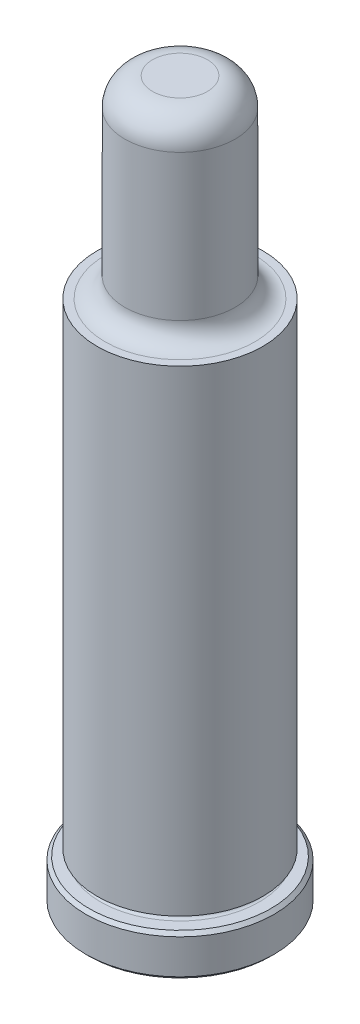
ISO-10303-21;
HEADER;
FILE_DESCRIPTION(('STEP AP214'),'2;1');
FILE_NAME('part.step','',(''),(''),'','','');
FILE_SCHEMA(('AUTOMOTIVE_DESIGN { 1 0 10303 214 1 1 1 1 }'));
ENDSEC;
DATA;
#1=APPLICATION_CONTEXT('core data for automotive mechanical design processes');
#2=APPLICATION_PROTOCOL_DEFINITION('international standard','automotive_design',2000,#1);
#3=PRODUCT_CONTEXT('',#1,'mechanical');
#4=PRODUCT('Part','Part','',(#3));
#5=PRODUCT_RELATED_PRODUCT_CATEGORY('part','',(#4));
#6=PRODUCT_DEFINITION_FORMATION('','',#4);
#7=PRODUCT_DEFINITION_CONTEXT('part definition',#1,'design');
#8=PRODUCT_DEFINITION('design','',#6,#7);
#9=PRODUCT_DEFINITION_SHAPE('','',#8);
#10=(LENGTH_UNIT() NAMED_UNIT(*) SI_UNIT(.MILLI.,.METRE.));
#11=(NAMED_UNIT(*) PLANE_ANGLE_UNIT() SI_UNIT($,.RADIAN.));
#12=(NAMED_UNIT(*) SI_UNIT($,.STERADIAN.) SOLID_ANGLE_UNIT());
#13=UNCERTAINTY_MEASURE_WITH_UNIT(LENGTH_MEASURE(1.E-05),#10,'distance_accuracy_value','');
#14=(GEOMETRIC_REPRESENTATION_CONTEXT(3) GLOBAL_UNCERTAINTY_ASSIGNED_CONTEXT((#13)) GLOBAL_UNIT_ASSIGNED_CONTEXT((#10,
#11,#12)) REPRESENTATION_CONTEXT('',''));
#15=CARTESIAN_POINT('',(0.,0.,0.));
#16=DIRECTION('',(0.,0.,1.));
#17=DIRECTION('',(1.,0.,0.));
#18=AXIS2_PLACEMENT_3D('',#15,#16,#17);
#19=CARTESIAN_POINT('',(0.,0.,0.));
#20=DIRECTION('',(0.,1.,0.));
#21=DIRECTION('',(0.,0.,1.));
#22=AXIS2_PLACEMENT_3D('',#19,#20,#21);
#23=PLANE('',#22);
#24=CARTESIAN_POINT('',(0.,0.,0.));
#25=DIRECTION('',(0.,1.,0.));
#26=DIRECTION('',(0.,0.,1.));
#27=AXIS2_PLACEMENT_3D('',#24,#25,#26);
#28=CIRCLE('',#27,10.4521);
#29=CARTESIAN_POINT('',(0.,0.,10.4521));
#30=VERTEX_POINT('',#29);
#31=EDGE_CURVE('E38',#30,#30,#28,.F.);
#32=ORIENTED_EDGE('',*,*,#31,.T.);
#33=EDGE_LOOP('',(#32));
#34=FACE_BOUND('',#33,.T.);
#35=ADVANCED_FACE('F31',(#34),#23,.F.);
#36=CARTESIAN_POINT('',(0.,0.,0.));
#37=DIRECTION('',(0.,1.,0.));
#38=DIRECTION('',(0.,0.,1.));
#39=AXIS2_PLACEMENT_3D('',#36,#37,#38);
#40=CYLINDRICAL_SURFACE('',#39,10.8331);
#41=CARTESIAN_POINT('',(0.,0.380999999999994,0.));
#42=DIRECTION('',(0.,1.,0.));
#43=DIRECTION('',(0.,0.,1.));
#44=AXIS2_PLACEMENT_3D('',#41,#42,#43);
#45=CIRCLE('',#44,10.8331);
#46=CARTESIAN_POINT('',(0.,0.380999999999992,10.8331));
#47=VERTEX_POINT('',#46);
#48=EDGE_CURVE('E42',#47,#47,#45,.T.);
#49=ORIENTED_EDGE('',*,*,#48,.T.);
#50=EDGE_LOOP('',(#49));
#51=FACE_BOUND('',#50,.T.);
#52=CARTESIAN_POINT('',(0.,4.36879999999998,0.));
#53=DIRECTION('',(0.,-1.,0.));
#54=DIRECTION('',(0.,0.,-1.));
#55=AXIS2_PLACEMENT_3D('',#52,#53,#54);
#56=CIRCLE('',#55,10.8331);
#57=CARTESIAN_POINT('',(0.,4.36879999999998,-10.8331));
#58=VERTEX_POINT('',#57);
#59=EDGE_CURVE('E46',#58,#58,#56,.T.);
#60=ORIENTED_EDGE('',*,*,#59,.T.);
#61=EDGE_LOOP('',(#60));
#62=FACE_BOUND('',#61,.T.);
#63=ADVANCED_FACE('F110',(#51,#62),#40,.T.);
#64=CARTESIAN_POINT('',(0.,4.7498,-10.8331));
#65=DIRECTION('',(0.,-1.,0.));
#66=DIRECTION('',(0.,0.,-1.));
#67=AXIS2_PLACEMENT_3D('',#64,#65,#66);
#68=PLANE('',#67);
#69=CARTESIAN_POINT('',(0.,4.7498,0.));
#70=DIRECTION('',(0.,-1.,0.));
#71=DIRECTION('',(0.,0.,-1.));
#72=AXIS2_PLACEMENT_3D('',#69,#70,#71);
#73=CIRCLE('',#72,10.4521);
#74=CARTESIAN_POINT('',(0.,4.7498,-10.4521));
#75=VERTEX_POINT('',#74);
#76=EDGE_CURVE('E10',#75,#75,#73,.F.);
#77=ORIENTED_EDGE('',*,*,#76,.T.);
#78=EDGE_LOOP('',(#77));
#79=FACE_BOUND('',#78,.T.);
#80=CARTESIAN_POINT('',(0.,4.7498,0.));
#81=DIRECTION('',(0.,1.,0.));
#82=DIRECTION('',(0.,0.,1.));
#83=AXIS2_PLACEMENT_3D('',#80,#81,#82);
#84=CIRCLE('',#83,9.13129999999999);
#85=CARTESIAN_POINT('',(0.,4.7498,9.13129999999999));
#86=VERTEX_POINT('',#85);
#87=EDGE_CURVE('E57',#86,#86,#84,.T.);
#88=ORIENTED_EDGE('',*,*,#87,.F.);
#89=EDGE_LOOP('',(#88));
#90=FACE_BOUND('',#89,.T.);
#91=ADVANCED_FACE('F105',(#79,#90),#68,.F.);
#92=CARTESIAN_POINT('',(0.,5.1308,0.));
#93=DIRECTION('',(0.,1.,0.));
#94=DIRECTION('',(0.,0.,1.));
#95=AXIS2_PLACEMENT_3D('',#92,#93,#94);
#96=TOROIDAL_SURFACE('',#95,9.13129999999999,0.381);
#97=CARTESIAN_POINT('',(0.,5.5118,0.));
#98=DIRECTION('',(0.,1.,0.));
#99=DIRECTION('',(0.,0.,1.));
#100=AXIS2_PLACEMENT_3D('',#97,#98,#99);
#101=CIRCLE('',#100,9.13129999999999);
#102=CARTESIAN_POINT('',(0.,5.5118,9.13129999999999));
#103=VERTEX_POINT('',#102);
#104=EDGE_CURVE('E60',#103,#103,#101,.T.);
#105=ORIENTED_EDGE('',*,*,#104,.F.);
#106=EDGE_LOOP('',(#105));
#107=FACE_BOUND('',#106,.T.);
#108=ORIENTED_EDGE('',*,*,#87,.T.);
#109=EDGE_LOOP('',(#108));
#110=FACE_BOUND('',#109,.T.);
#111=ADVANCED_FACE('F99',(#107,#110),#96,.F.);
#112=CARTESIAN_POINT('',(0.,5.5118,-9.13129999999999));
#113=DIRECTION('',(0.,1.,0.));
#114=DIRECTION('',(0.,0.,1.));
#115=AXIS2_PLACEMENT_3D('',#112,#113,#114);
#116=PLANE('',#115);
#117=CARTESIAN_POINT('',(0.,5.5118,0.));
#118=DIRECTION('',(0.,1.,0.));
#119=DIRECTION('',(0.,0.,1.));
#120=AXIS2_PLACEMENT_3D('',#117,#118,#119);
#121=CIRCLE('',#120,9.53769999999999);
#122=CARTESIAN_POINT('',(0.,5.5118,9.53769999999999));
#123=VERTEX_POINT('',#122);
#124=EDGE_CURVE('E63',#123,#123,#121,.T.);
#125=ORIENTED_EDGE('',*,*,#124,.F.);
#126=EDGE_LOOP('',(#125));
#127=FACE_BOUND('',#126,.T.);
#128=ORIENTED_EDGE('',*,*,#104,.T.);
#129=EDGE_LOOP('',(#128));
#130=FACE_BOUND('',#129,.T.);
#131=ADVANCED_FACE('F93',(#127,#130),#116,.F.);
#132=CARTESIAN_POINT('',(0.,0.,0.));
#133=DIRECTION('',(0.,1.,0.));
#134=DIRECTION('',(0.,0.,1.));
#135=AXIS2_PLACEMENT_3D('',#132,#133,#134);
#136=CYLINDRICAL_SURFACE('',#135,9.53769999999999);
#137=CARTESIAN_POINT('',(0.,60.325,0.));
#138=DIRECTION('',(0.,1.,0.));
#139=DIRECTION('',(0.,0.,1.));
#140=AXIS2_PLACEMENT_3D('',#137,#138,#139);
#141=CIRCLE('',#140,9.53769999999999);
#142=CARTESIAN_POINT('',(0.,60.325,9.5377));
#143=VERTEX_POINT('',#142);
#144=EDGE_CURVE('E66',#143,#143,#141,.T.);
#145=ORIENTED_EDGE('',*,*,#144,.F.);
#146=EDGE_LOOP('',(#145));
#147=FACE_BOUND('',#146,.T.);
#148=ORIENTED_EDGE('',*,*,#124,.T.);
#149=EDGE_LOOP('',(#148));
#150=FACE_BOUND('',#149,.T.);
#151=ADVANCED_FACE('F87',(#147,#150),#136,.T.);
#152=CARTESIAN_POINT('',(0.,60.325,-9.53769999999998));
#153=DIRECTION('',(0.,-1.,0.));
#154=DIRECTION('',(0.,0.,-1.));
#155=AXIS2_PLACEMENT_3D('',#152,#153,#154);
#156=PLANE('',#155);
#157=CARTESIAN_POINT('',(0.,60.325,0.));
#158=DIRECTION('',(0.,1.,0.));
#159=DIRECTION('',(0.,0.,1.));
#160=AXIS2_PLACEMENT_3D('',#157,#158,#159);
#161=CIRCLE('',#160,8.6233);
#162=CARTESIAN_POINT('',(0.,60.325,8.62330000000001));
#163=VERTEX_POINT('',#162);
#164=EDGE_CURVE('E69',#163,#163,#161,.T.);
#165=ORIENTED_EDGE('',*,*,#164,.F.);
#166=EDGE_LOOP('',(#165));
#167=FACE_BOUND('',#166,.T.);
#168=ORIENTED_EDGE('',*,*,#144,.T.);
#169=EDGE_LOOP('',(#168));
#170=FACE_BOUND('',#169,.T.);
#171=ADVANCED_FACE('F81',(#167,#170),#156,.F.);
#172=CARTESIAN_POINT('',(0.,62.611,0.));
#173=DIRECTION('',(0.,1.,0.));
#174=DIRECTION('',(0.,0.,1.));
#175=AXIS2_PLACEMENT_3D('',#172,#173,#174);
#176=TOROIDAL_SURFACE('',#175,8.6233,2.286);
#177=CARTESIAN_POINT('',(0.,62.611,0.));
#178=DIRECTION('',(0.,1.,0.));
#179=DIRECTION('',(0.,0.,1.));
#180=AXIS2_PLACEMENT_3D('',#177,#178,#179);
#181=CIRCLE('',#180,6.3373);
#182=CARTESIAN_POINT('',(0.,62.611,6.33730000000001));
#183=VERTEX_POINT('',#182);
#184=EDGE_CURVE('E72',#183,#183,#181,.T.);
#185=ORIENTED_EDGE('',*,*,#184,.F.);
#186=EDGE_LOOP('',(#185));
#187=FACE_BOUND('',#186,.T.);
#188=ORIENTED_EDGE('',*,*,#164,.T.);
#189=EDGE_LOOP('',(#188));
#190=FACE_BOUND('',#189,.T.);
#191=ADVANCED_FACE('F78',(#187,#190),#176,.F.);
#192=CARTESIAN_POINT('',(0.,0.,0.));
#193=DIRECTION('',(0.,1.,0.));
#194=DIRECTION('',(0.,0.,1.));
#195=AXIS2_PLACEMENT_3D('',#192,#193,#194);
#196=CYLINDRICAL_SURFACE('',#195,6.3373);
#197=CARTESIAN_POINT('',(0.,79.375,0.));
#198=DIRECTION('',(0.,-1.,0.));
#199=DIRECTION('',(0.,0.,-1.));
#200=AXIS2_PLACEMENT_3D('',#197,#198,#199);
#201=CIRCLE('',#200,6.3373);
#202=CARTESIAN_POINT('',(0.,79.375,-6.33729999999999));
#203=VERTEX_POINT('',#202);
#204=EDGE_CURVE('E51',#203,#203,#201,.T.);
#205=ORIENTED_EDGE('',*,*,#204,.T.);
#206=EDGE_LOOP('',(#205));
#207=FACE_BOUND('',#206,.T.);
#208=ORIENTED_EDGE('',*,*,#184,.T.);
#209=EDGE_LOOP('',(#208));
#210=FACE_BOUND('',#209,.T.);
#211=ADVANCED_FACE('F76',(#207,#210),#196,.T.);
#212=CARTESIAN_POINT('',(0.,82.55,-6.33729999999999));
#213=DIRECTION('',(0.,-1.,0.));
#214=DIRECTION('',(0.,0.,-1.));
#215=AXIS2_PLACEMENT_3D('',#212,#213,#214);
#216=PLANE('',#215);
#217=CARTESIAN_POINT('',(0.,82.55,0.));
#218=DIRECTION('',(0.,-1.,0.));
#219=DIRECTION('',(0.,0.,-1.));
#220=AXIS2_PLACEMENT_3D('',#217,#218,#219);
#221=CIRCLE('',#220,3.1623);
#222=CARTESIAN_POINT('',(0.,82.55,-3.16229999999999));
#223=VERTEX_POINT('',#222);
#224=EDGE_CURVE('E54',#223,#223,#221,.F.);
#225=ORIENTED_EDGE('',*,*,#224,.T.);
#226=EDGE_LOOP('',(#225));
#227=FACE_BOUND('',#226,.T.);
#228=ADVANCED_FACE('F125',(#227),#216,.F.);
#229=CARTESIAN_POINT('',(0.,79.375,0.));
#230=DIRECTION('',(0.,-1.,0.));
#231=DIRECTION('',(0.,0.,-1.));
#232=AXIS2_PLACEMENT_3D('',#229,#230,#231);
#233=DEGENERATE_TOROIDAL_SURFACE('',#232,3.1623,3.175,.T.);
#234=ORIENTED_EDGE('',*,*,#204,.F.);
#235=EDGE_LOOP('',(#234));
#236=FACE_BOUND('',#235,.T.);
#237=ORIENTED_EDGE('',*,*,#224,.F.);
#238=EDGE_LOOP('',(#237));
#239=FACE_BOUND('',#238,.T.);
#240=ADVANCED_FACE('F122',(#236,#239),#233,.T.);
#241=CARTESIAN_POINT('',(0.,0.380999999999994,0.));
#242=DIRECTION('',(0.,1.,0.));
#243=DIRECTION('',(0.,0.,1.));
#244=AXIS2_PLACEMENT_3D('',#241,#242,#243);
#245=CONICAL_SURFACE('',#244,10.8331,0.785398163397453);
#246=ORIENTED_EDGE('',*,*,#31,.F.);
#247=EDGE_LOOP('',(#246));
#248=FACE_BOUND('',#247,.T.);
#249=ORIENTED_EDGE('',*,*,#48,.F.);
#250=EDGE_LOOP('',(#249));
#251=FACE_BOUND('',#250,.T.);
#252=ADVANCED_FACE('F124',(#248,#251),#245,.T.);
#253=CARTESIAN_POINT('',(0.,4.7498,0.));
#254=DIRECTION('',(0.,-1.,0.));
#255=DIRECTION('',(0.,0.,-1.));
#256=AXIS2_PLACEMENT_3D('',#253,#254,#255);
#257=CONICAL_SURFACE('',#256,10.4521,0.785398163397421);
#258=ORIENTED_EDGE('',*,*,#59,.F.);
#259=EDGE_LOOP('',(#258));
#260=FACE_BOUND('',#259,.T.);
#261=ORIENTED_EDGE('',*,*,#76,.F.);
#262=EDGE_LOOP('',(#261));
#263=FACE_BOUND('',#262,.T.);
#264=ADVANCED_FACE('F33',(#260,#263),#257,.T.);
#265=CLOSED_SHELL('',(#35,#63,#91,#111,#131,#151,#171,#191,#211,#228,#240,#252,#264));
#266=MANIFOLD_SOLID_BREP('B2',#265);
#267=ADVANCED_BREP_SHAPE_REPRESENTATION('',(#18,#266),#14);
#268=SHAPE_DEFINITION_REPRESENTATION(#9,#267);
ENDSEC;
END-ISO-10303-21;
